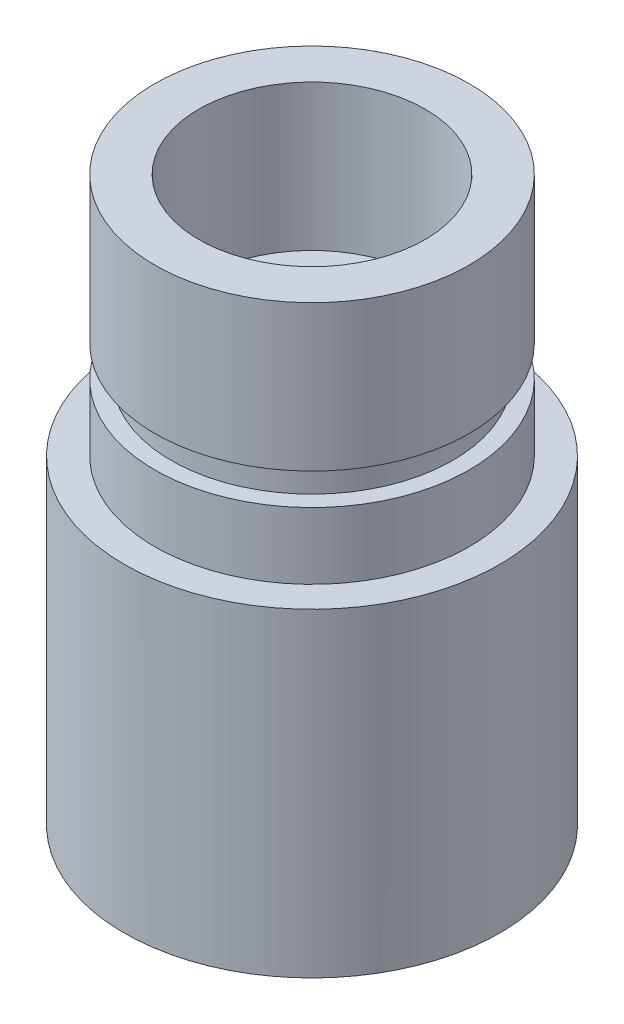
from build123d import *

# Parameters (mm, degrees)
CUT_EXTRUDE1_REACH      = 44.121
CUT_EXTRUDE1_END_RADIUS = 12.7


with BuildPart() as part:
    # Sketch1 → Revolve1 (revolve)
    with BuildSketch(Plane.XY, mode=Mode.PRIVATE) as revolve1_sk:
        Polygon((-7.3, 0), (-12.7, 0), (-12.7, 21.6), (-10.635, 21.6), (-10.635, 26.1), (-9.525, 26.1), (-9.525, 28.2336), (-10.635, 28.2336), (-10.635, 38.1), (-7.65, 38.1), (-7.65, 28.2336), (-2, 28.2336), (-2, 24), (-7.3, 24), align=None)
    revolve(revolve1_sk.sketch.rotate(Axis((0, 0, 0), (0, 1, 0)), 270), axis=Axis((0, 0, 0), (0, 1, 0)))

    # Cut-Extrude1: up to this cylinder (the profile starts inside it)
    cut_extrude1_end = Plane(origin=(0, 6.030211, 0), z_dir=(0, -1, 0)) * Cylinder(CUT_EXTRUDE1_END_RADIUS, 114.642, mode=Mode.PRIVATE)
    # Sketch2 → Cut-Extrude1 (cut, up to the surface)
    with BuildSketch(Plane(origin=(0, 0, 0), x_dir=(0, 0, -1), z_dir=(1, 0, 0)), mode=Mode.PRIVATE) as cut_extrude1_sk1:
        with BuildLine():
            Line((3.175, 0), (-3.175, 0))
            Line((-3.175, 0), (-3.175, 9.525))
            ThreePointArc((-3.175, 9.525), (0, 12.7), (3.175, 9.525))
            Line((3.175, 9.525), (3.175, 0))
        make_face()
    cut_extrude1_tool1 = extrude(cut_extrude1_sk1.sketch, amount=-CUT_EXTRUDE1_REACH, mode=Mode.PRIVATE) & cut_extrude1_end
    add(cut_extrude1_tool1.solids().sort_by_distance((0, 6.030211, 0))[0], mode=Mode.SUBTRACT)


solid = part.part
